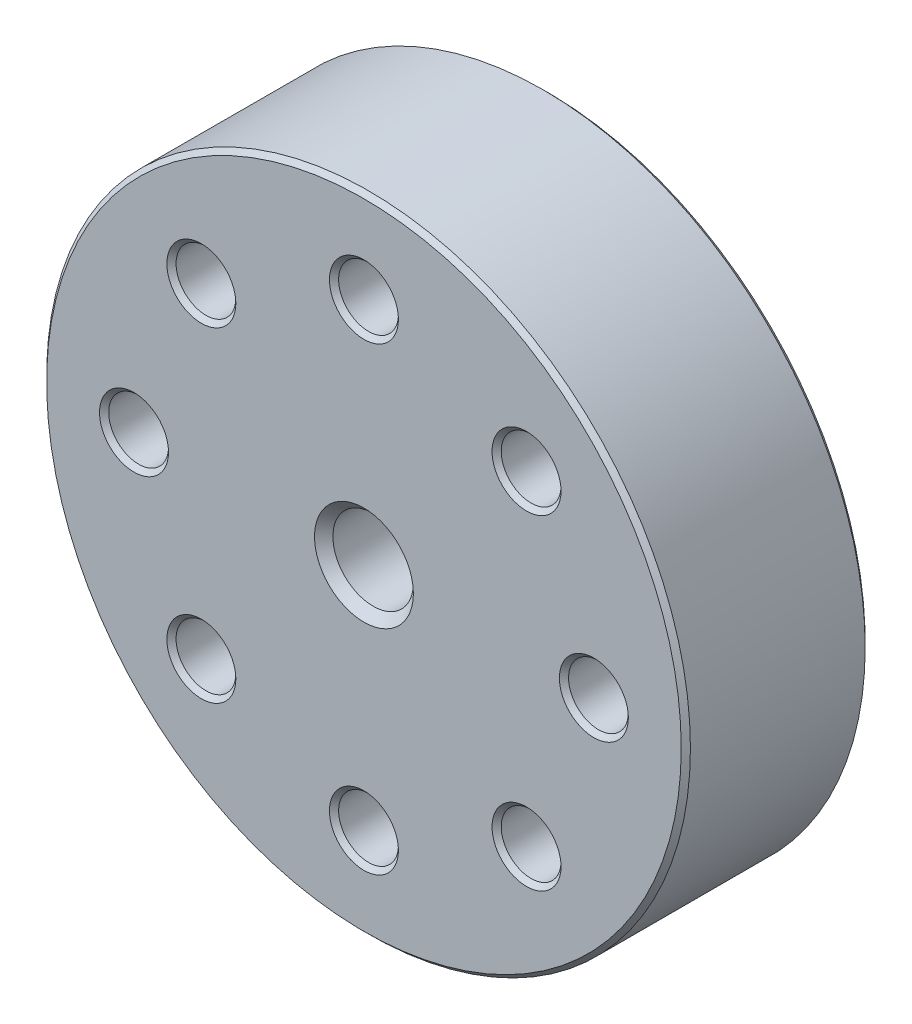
ISO-10303-21;
HEADER;
FILE_DESCRIPTION(('STEP AP214'),'2;1');
FILE_NAME('part.step','',(''),(''),'','','');
FILE_SCHEMA(('AUTOMOTIVE_DESIGN { 1 0 10303 214 1 1 1 1 }'));
ENDSEC;
DATA;
#1=APPLICATION_CONTEXT('core data for automotive mechanical design processes');
#2=APPLICATION_PROTOCOL_DEFINITION('international standard','automotive_design',2000,#1);
#3=PRODUCT_CONTEXT('',#1,'mechanical');
#4=PRODUCT('Part','Part','',(#3));
#5=PRODUCT_RELATED_PRODUCT_CATEGORY('part','',(#4));
#6=PRODUCT_DEFINITION_FORMATION('','',#4);
#7=PRODUCT_DEFINITION_CONTEXT('part definition',#1,'design');
#8=PRODUCT_DEFINITION('design','',#6,#7);
#9=PRODUCT_DEFINITION_SHAPE('','',#8);
#10=(LENGTH_UNIT() NAMED_UNIT(*) SI_UNIT(.MILLI.,.METRE.));
#11=(NAMED_UNIT(*) PLANE_ANGLE_UNIT() SI_UNIT($,.RADIAN.));
#12=(NAMED_UNIT(*) SI_UNIT($,.STERADIAN.) SOLID_ANGLE_UNIT());
#13=UNCERTAINTY_MEASURE_WITH_UNIT(LENGTH_MEASURE(1.E-05),#10,'distance_accuracy_value','');
#14=(GEOMETRIC_REPRESENTATION_CONTEXT(3) GLOBAL_UNCERTAINTY_ASSIGNED_CONTEXT((#13)) GLOBAL_UNIT_ASSIGNED_CONTEXT((#10,
#11,#12)) REPRESENTATION_CONTEXT('',''));
#15=CARTESIAN_POINT('',(0.,0.,0.));
#16=DIRECTION('',(0.,0.,1.));
#17=DIRECTION('',(1.,0.,0.));
#18=AXIS2_PLACEMENT_3D('',#15,#16,#17);
#19=CARTESIAN_POINT('',(0.,0.,0.));
#20=DIRECTION('',(0.,0.,-1.));
#21=DIRECTION('',(-1.,0.,0.));
#22=AXIS2_PLACEMENT_3D('',#19,#20,#21);
#23=CYLINDRICAL_SURFACE('',#22,1.5);
#24=CARTESIAN_POINT('',(0.,0.,-16.));
#25=DIRECTION('',(0.,0.,1.));
#26=DIRECTION('',(1.,0.,0.));
#27=AXIS2_PLACEMENT_3D('',#24,#25,#26);
#28=CIRCLE('',#27,1.5);
#29=CARTESIAN_POINT('',(1.5,0.,-16.));
#30=VERTEX_POINT('',#29);
#31=EDGE_CURVE('E173',#30,#30,#28,.F.);
#32=ORIENTED_EDGE('',*,*,#31,.F.);
#33=EDGE_LOOP('',(#32));
#34=FACE_BOUND('',#33,.T.);
#35=CARTESIAN_POINT('',(0.,0.,-34.));
#36=DIRECTION('',(0.,0.,-1.));
#37=DIRECTION('',(-1.,0.,0.));
#38=AXIS2_PLACEMENT_3D('',#35,#36,#37);
#39=CIRCLE('',#38,1.5);
#40=CARTESIAN_POINT('',(-1.5,0.,-34.));
#41=VERTEX_POINT('',#40);
#42=EDGE_CURVE('E181',#41,#41,#39,.F.);
#43=ORIENTED_EDGE('',*,*,#42,.F.);
#44=EDGE_LOOP('',(#43));
#45=FACE_BOUND('',#44,.T.);
#46=ADVANCED_FACE('F32',(#34,#45),#23,.F.);
#47=CARTESIAN_POINT('',(0.,0.,115.669329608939));
#48=DIRECTION('',(0.,0.,1.));
#49=DIRECTION('',(1.,0.,0.));
#50=AXIS2_PLACEMENT_3D('',#47,#48,#49);
#51=CYLINDRICAL_SURFACE('',#50,5.);
#52=CARTESIAN_POINT('',(0.,0.,-33.));
#53=DIRECTION('',(0.,0.,-1.));
#54=DIRECTION('',(-1.,0.,0.));
#55=AXIS2_PLACEMENT_3D('',#52,#53,#54);
#56=CIRCLE('',#55,5.);
#57=CARTESIAN_POINT('',(-5.,0.,-33.));
#58=VERTEX_POINT('',#57);
#59=EDGE_CURVE('E39',#58,#58,#56,.F.);
#60=ORIENTED_EDGE('',*,*,#59,.T.);
#61=EDGE_LOOP('',(#60));
#62=FACE_BOUND('',#61,.T.);
#63=CARTESIAN_POINT('',(0.,0.,-23.5));
#64=DIRECTION('',(0.,0.,1.));
#65=DIRECTION('',(1.,0.,0.));
#66=AXIS2_PLACEMENT_3D('',#63,#64,#65);
#67=CIRCLE('',#66,5.);
#68=CARTESIAN_POINT('',(5.,0.,-23.5));
#69=VERTEX_POINT('',#68);
#70=EDGE_CURVE('E70',#69,#69,#67,.F.);
#71=ORIENTED_EDGE('',*,*,#70,.T.);
#72=EDGE_LOOP('',(#71));
#73=FACE_BOUND('',#72,.T.);
#74=ADVANCED_FACE('F188',(#62,#73),#51,.T.);
#75=CARTESIAN_POINT('',(0.,-4.25,-23.));
#76=DIRECTION('',(0.,0.,1.));
#77=DIRECTION('',(1.,0.,0.));
#78=AXIS2_PLACEMENT_3D('',#75,#76,#77);
#79=PLANE('',#78);
#80=CARTESIAN_POINT('',(0.,0.,-23.));
#81=DIRECTION('',(0.,0.,1.));
#82=DIRECTION('',(1.,0.,0.));
#83=AXIS2_PLACEMENT_3D('',#80,#81,#82);
#84=CIRCLE('',#83,4.49999999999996);
#85=CARTESIAN_POINT('',(4.49999999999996,0.,-23.));
#86=VERTEX_POINT('',#85);
#87=EDGE_CURVE('E73',#86,#86,#84,.T.);
#88=ORIENTED_EDGE('',*,*,#87,.T.);
#89=EDGE_LOOP('',(#88));
#90=FACE_BOUND('',#89,.T.);
#91=CARTESIAN_POINT('',(0.,0.,-23.));
#92=DIRECTION('',(0.,0.,1.));
#93=DIRECTION('',(1.,0.,0.));
#94=AXIS2_PLACEMENT_3D('',#91,#92,#93);
#95=CIRCLE('',#94,4.25);
#96=CARTESIAN_POINT('',(4.25,0.,-23.));
#97=VERTEX_POINT('',#96);
#98=EDGE_CURVE('E172',#97,#97,#95,.T.);
#99=ORIENTED_EDGE('',*,*,#98,.F.);
#100=EDGE_LOOP('',(#99));
#101=FACE_BOUND('',#100,.T.);
#102=ADVANCED_FACE('F194',(#90,#101),#79,.T.);
#103=CARTESIAN_POINT('',(0.,0.,115.669329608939));
#104=DIRECTION('',(0.,0.,1.));
#105=DIRECTION('',(1.,0.,0.));
#106=AXIS2_PLACEMENT_3D('',#103,#104,#105);
#107=CYLINDRICAL_SURFACE('',#106,4.25);
#108=CARTESIAN_POINT('',(0.,0.,-20.5));
#109=DIRECTION('',(0.,0.,-1.));
#110=DIRECTION('',(-1.,0.,0.));
#111=AXIS2_PLACEMENT_3D('',#108,#109,#110);
#112=CIRCLE('',#111,4.25);
#113=CARTESIAN_POINT('',(-4.25,0.,-20.5));
#114=VERTEX_POINT('',#113);
#115=EDGE_CURVE('E61',#114,#114,#112,.T.);
#116=ORIENTED_EDGE('',*,*,#115,.T.);
#117=EDGE_LOOP('',(#116));
#118=FACE_BOUND('',#117,.T.);
#119=ORIENTED_EDGE('',*,*,#98,.T.);
#120=EDGE_LOOP('',(#119));
#121=FACE_BOUND('',#120,.T.);
#122=ADVANCED_FACE('F213',(#118,#121),#107,.T.);
#123=CARTESIAN_POINT('',(0.,-35.,-20.));
#124=DIRECTION('',(0.,0.,-1.));
#125=DIRECTION('',(-1.,0.,0.));
#126=AXIS2_PLACEMENT_3D('',#123,#124,#125);
#127=PLANE('',#126);
#128=CARTESIAN_POINT('',(0.,0.,-20.));
#129=DIRECTION('',(0.,0.,-1.));
#130=DIRECTION('',(-1.,0.,0.));
#131=AXIS2_PLACEMENT_3D('',#128,#129,#130);
#132=CIRCLE('',#131,4.74999999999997);
#133=CARTESIAN_POINT('',(-4.74999999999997,0.,-20.));
#134=VERTEX_POINT('',#133);
#135=EDGE_CURVE('E64',#134,#134,#132,.F.);
#136=ORIENTED_EDGE('',*,*,#135,.T.);
#137=EDGE_LOOP('',(#136));
#138=FACE_BOUND('',#137,.T.);
#139=CARTESIAN_POINT('',(0.,0.,-20.));
#140=DIRECTION('',(0.,0.,-1.));
#141=DIRECTION('',(-1.,0.,0.));
#142=AXIS2_PLACEMENT_3D('',#139,#140,#141);
#143=CIRCLE('',#142,34.5);
#144=CARTESIAN_POINT('',(-34.5,0.,-20.));
#145=VERTEX_POINT('',#144);
#146=EDGE_CURVE('E67',#145,#145,#143,.T.);
#147=ORIENTED_EDGE('',*,*,#146,.T.);
#148=EDGE_LOOP('',(#147));
#149=FACE_BOUND('',#148,.T.);
#150=CARTESIAN_POINT('',(-17.6776695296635,17.6776695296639,-20.));
#151=DIRECTION('',(0.,0.,-1.));
#152=DIRECTION('',(-1.,0.,0.));
#153=AXIS2_PLACEMENT_3D('',#150,#151,#152);
#154=CIRCLE('',#153,3.75000000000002);
#155=CARTESIAN_POINT('',(-21.4276695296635,17.6776695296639,-20.));
#156=VERTEX_POINT('',#155);
#157=EDGE_CURVE('E79',#156,#156,#154,.F.);
#158=ORIENTED_EDGE('',*,*,#157,.T.);
#159=EDGE_LOOP('',(#158));
#160=FACE_BOUND('',#159,.T.);
#161=CARTESIAN_POINT('',(-25.,2.61861252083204E-13,-20.));
#162=DIRECTION('',(0.,0.,-1.));
#163=DIRECTION('',(-1.,0.,0.));
#164=AXIS2_PLACEMENT_3D('',#161,#162,#163);
#165=CIRCLE('',#164,3.75000000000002);
#166=CARTESIAN_POINT('',(-28.75,2.61861252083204E-13,-20.));
#167=VERTEX_POINT('',#166);
#168=EDGE_CURVE('E91',#167,#167,#165,.F.);
#169=ORIENTED_EDGE('',*,*,#168,.T.);
#170=EDGE_LOOP('',(#169));
#171=FACE_BOUND('',#170,.T.);
#172=CARTESIAN_POINT('',(-17.6776695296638,-17.6776695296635,-20.));
#173=DIRECTION('',(0.,0.,-1.));
#174=DIRECTION('',(-1.,0.,0.));
#175=AXIS2_PLACEMENT_3D('',#172,#173,#174);
#176=CIRCLE('',#175,3.75000000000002);
#177=CARTESIAN_POINT('',(-21.4276695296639,-17.6776695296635,-20.));
#178=VERTEX_POINT('',#177);
#179=EDGE_CURVE('E103',#178,#178,#176,.F.);
#180=ORIENTED_EDGE('',*,*,#179,.T.);
#181=EDGE_LOOP('',(#180));
#182=FACE_BOUND('',#181,.T.);
#183=CARTESIAN_POINT('',(-1.74574168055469E-13,-25.,-20.));
#184=DIRECTION('',(0.,0.,-1.));
#185=DIRECTION('',(-1.,0.,0.));
#186=AXIS2_PLACEMENT_3D('',#183,#184,#185);
#187=CIRCLE('',#186,3.75000000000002);
#188=CARTESIAN_POINT('',(-3.75000000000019,-25.,-20.));
#189=VERTEX_POINT('',#188);
#190=EDGE_CURVE('E115',#189,#189,#187,.F.);
#191=ORIENTED_EDGE('',*,*,#190,.T.);
#192=EDGE_LOOP('',(#191));
#193=FACE_BOUND('',#192,.T.);
#194=CARTESIAN_POINT('',(17.6776695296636,-17.6776695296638,-20.));
#195=DIRECTION('',(0.,0.,-1.));
#196=DIRECTION('',(-1.,0.,0.));
#197=AXIS2_PLACEMENT_3D('',#194,#195,#196);
#198=CIRCLE('',#197,3.75000000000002);
#199=CARTESIAN_POINT('',(13.9276695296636,-17.6776695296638,-20.));
#200=VERTEX_POINT('',#199);
#201=EDGE_CURVE('E127',#200,#200,#198,.F.);
#202=ORIENTED_EDGE('',*,*,#201,.T.);
#203=EDGE_LOOP('',(#202));
#204=FACE_BOUND('',#203,.T.);
#205=CARTESIAN_POINT('',(25.,0.,-20.));
#206=DIRECTION('',(0.,0.,-1.));
#207=DIRECTION('',(-1.,0.,0.));
#208=AXIS2_PLACEMENT_3D('',#205,#206,#207);
#209=CIRCLE('',#208,3.75000000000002);
#210=CARTESIAN_POINT('',(21.25,0.,-20.));
#211=VERTEX_POINT('',#210);
#212=EDGE_CURVE('E139',#211,#211,#209,.F.);
#213=ORIENTED_EDGE('',*,*,#212,.T.);
#214=EDGE_LOOP('',(#213));
#215=FACE_BOUND('',#214,.T.);
#216=CARTESIAN_POINT('',(17.6776695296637,17.6776695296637,-20.));
#217=DIRECTION('',(0.,0.,-1.));
#218=DIRECTION('',(-1.,0.,0.));
#219=AXIS2_PLACEMENT_3D('',#216,#217,#218);
#220=CIRCLE('',#219,3.74999999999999);
#221=CARTESIAN_POINT('',(13.9276695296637,17.6776695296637,-20.));
#222=VERTEX_POINT('',#221);
#223=EDGE_CURVE('E151',#222,#222,#220,.F.);
#224=ORIENTED_EDGE('',*,*,#223,.T.);
#225=EDGE_LOOP('',(#224));
#226=FACE_BOUND('',#225,.T.);
#227=CARTESIAN_POINT('',(0.,25.,-20.));
#228=DIRECTION('',(0.,0.,-1.));
#229=DIRECTION('',(-1.,0.,0.));
#230=AXIS2_PLACEMENT_3D('',#227,#228,#229);
#231=CIRCLE('',#230,3.75000000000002);
#232=CARTESIAN_POINT('',(-3.75000000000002,25.,-20.));
#233=VERTEX_POINT('',#232);
#234=EDGE_CURVE('E163',#233,#233,#231,.F.);
#235=ORIENTED_EDGE('',*,*,#234,.T.);
#236=EDGE_LOOP('',(#235));
#237=FACE_BOUND('',#236,.T.);
#238=ADVANCED_FACE('F209',(#138,#149,#160,#171,#182,#193,#204,#215,#226,#237),#127,.T.);
#239=CARTESIAN_POINT('',(0.,0.,115.669329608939));
#240=DIRECTION('',(0.,0.,1.));
#241=DIRECTION('',(1.,0.,0.));
#242=AXIS2_PLACEMENT_3D('',#239,#240,#241);
#243=CYLINDRICAL_SURFACE('',#242,35.);
#244=CARTESIAN_POINT('',(0.,0.,-0.499999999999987));
#245=DIRECTION('',(0.,0.,1.));
#246=DIRECTION('',(1.,0.,0.));
#247=AXIS2_PLACEMENT_3D('',#244,#245,#246);
#248=CIRCLE('',#247,35.);
#249=CARTESIAN_POINT('',(35.,0.,-0.499999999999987));
#250=VERTEX_POINT('',#249);
#251=EDGE_CURVE('E52',#250,#250,#248,.F.);
#252=ORIENTED_EDGE('',*,*,#251,.T.);
#253=EDGE_LOOP('',(#252));
#254=FACE_BOUND('',#253,.T.);
#255=CARTESIAN_POINT('',(0.,0.,-19.5));
#256=DIRECTION('',(0.,0.,-1.));
#257=DIRECTION('',(-1.,0.,0.));
#258=AXIS2_PLACEMENT_3D('',#255,#256,#257);
#259=CIRCLE('',#258,35.);
#260=CARTESIAN_POINT('',(-35.,0.,-19.5));
#261=VERTEX_POINT('',#260);
#262=EDGE_CURVE('E55',#261,#261,#259,.F.);
#263=ORIENTED_EDGE('',*,*,#262,.T.);
#264=EDGE_LOOP('',(#263));
#265=FACE_BOUND('',#264,.T.);
#266=ADVANCED_FACE('F205',(#254,#265),#243,.T.);
#267=CARTESIAN_POINT('',(0.,0.,0.));
#268=DIRECTION('',(0.,0.,1.));
#269=DIRECTION('',(1.,0.,0.));
#270=AXIS2_PLACEMENT_3D('',#267,#268,#269);
#271=PLANE('',#270);
#272=CARTESIAN_POINT('',(0.,0.,0.));
#273=DIRECTION('',(0.,0.,1.));
#274=DIRECTION('',(1.,0.,0.));
#275=AXIS2_PLACEMENT_3D('',#272,#273,#274);
#276=CIRCLE('',#275,5.37499999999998);
#277=CARTESIAN_POINT('',(5.37499999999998,0.,0.));
#278=VERTEX_POINT('',#277);
#279=EDGE_CURVE('E43',#278,#278,#276,.F.);
#280=ORIENTED_EDGE('',*,*,#279,.T.);
#281=EDGE_LOOP('',(#280));
#282=FACE_BOUND('',#281,.T.);
#283=CARTESIAN_POINT('',(0.,0.,0.));
#284=DIRECTION('',(0.,0.,1.));
#285=DIRECTION('',(1.,0.,0.));
#286=AXIS2_PLACEMENT_3D('',#283,#284,#285);
#287=CIRCLE('',#286,34.5);
#288=CARTESIAN_POINT('',(34.5,0.,0.));
#289=VERTEX_POINT('',#288);
#290=EDGE_CURVE('E58',#289,#289,#287,.T.);
#291=ORIENTED_EDGE('',*,*,#290,.T.);
#292=EDGE_LOOP('',(#291));
#293=FACE_BOUND('',#292,.T.);
#294=CARTESIAN_POINT('',(-17.6776695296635,17.6776695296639,0.));
#295=DIRECTION('',(0.,0.,1.));
#296=DIRECTION('',(1.,0.,0.));
#297=AXIS2_PLACEMENT_3D('',#294,#295,#296);
#298=CIRCLE('',#297,3.74999999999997);
#299=CARTESIAN_POINT('',(-13.9276695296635,17.6776695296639,0.));
#300=VERTEX_POINT('',#299);
#301=EDGE_CURVE('E76',#300,#300,#298,.F.);
#302=ORIENTED_EDGE('',*,*,#301,.T.);
#303=EDGE_LOOP('',(#302));
#304=FACE_BOUND('',#303,.T.);
#305=CARTESIAN_POINT('',(-25.,2.61861252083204E-13,0.));
#306=DIRECTION('',(0.,0.,1.));
#307=DIRECTION('',(1.,0.,0.));
#308=AXIS2_PLACEMENT_3D('',#305,#306,#307);
#309=CIRCLE('',#308,3.74999999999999);
#310=CARTESIAN_POINT('',(-21.25,2.61861252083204E-13,0.));
#311=VERTEX_POINT('',#310);
#312=EDGE_CURVE('E88',#311,#311,#309,.F.);
#313=ORIENTED_EDGE('',*,*,#312,.T.);
#314=EDGE_LOOP('',(#313));
#315=FACE_BOUND('',#314,.T.);
#316=CARTESIAN_POINT('',(-17.6776695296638,-17.6776695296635,0.));
#317=DIRECTION('',(0.,0.,1.));
#318=DIRECTION('',(1.,0.,0.));
#319=AXIS2_PLACEMENT_3D('',#316,#317,#318);
#320=CIRCLE('',#319,3.75000000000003);
#321=CARTESIAN_POINT('',(-13.9276695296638,-17.6776695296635,0.));
#322=VERTEX_POINT('',#321);
#323=EDGE_CURVE('E100',#322,#322,#320,.F.);
#324=ORIENTED_EDGE('',*,*,#323,.T.);
#325=EDGE_LOOP('',(#324));
#326=FACE_BOUND('',#325,.T.);
#327=CARTESIAN_POINT('',(-1.74574168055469E-13,-25.,0.));
#328=DIRECTION('',(0.,0.,1.));
#329=DIRECTION('',(1.,0.,0.));
#330=AXIS2_PLACEMENT_3D('',#327,#328,#329);
#331=CIRCLE('',#330,3.74999999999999);
#332=CARTESIAN_POINT('',(3.74999999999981,-25.,0.));
#333=VERTEX_POINT('',#332);
#334=EDGE_CURVE('E112',#333,#333,#331,.F.);
#335=ORIENTED_EDGE('',*,*,#334,.T.);
#336=EDGE_LOOP('',(#335));
#337=FACE_BOUND('',#336,.T.);
#338=CARTESIAN_POINT('',(17.6776695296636,-17.6776695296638,0.));
#339=DIRECTION('',(0.,0.,1.));
#340=DIRECTION('',(1.,0.,0.));
#341=AXIS2_PLACEMENT_3D('',#338,#339,#340);
#342=CIRCLE('',#341,3.74999999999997);
#343=CARTESIAN_POINT('',(21.4276695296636,-17.6776695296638,0.));
#344=VERTEX_POINT('',#343);
#345=EDGE_CURVE('E124',#344,#344,#342,.F.);
#346=ORIENTED_EDGE('',*,*,#345,.T.);
#347=EDGE_LOOP('',(#346));
#348=FACE_BOUND('',#347,.T.);
#349=CARTESIAN_POINT('',(25.,0.,0.));
#350=DIRECTION('',(0.,0.,1.));
#351=DIRECTION('',(1.,0.,0.));
#352=AXIS2_PLACEMENT_3D('',#349,#350,#351);
#353=CIRCLE('',#352,3.74999999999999);
#354=CARTESIAN_POINT('',(28.75,0.,0.));
#355=VERTEX_POINT('',#354);
#356=EDGE_CURVE('E136',#355,#355,#353,.F.);
#357=ORIENTED_EDGE('',*,*,#356,.T.);
#358=EDGE_LOOP('',(#357));
#359=FACE_BOUND('',#358,.T.);
#360=CARTESIAN_POINT('',(17.6776695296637,17.6776695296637,0.));
#361=DIRECTION('',(0.,0.,1.));
#362=DIRECTION('',(1.,0.,0.));
#363=AXIS2_PLACEMENT_3D('',#360,#361,#362);
#364=CIRCLE('',#363,3.74999999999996);
#365=CARTESIAN_POINT('',(21.4276695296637,17.6776695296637,0.));
#366=VERTEX_POINT('',#365);
#367=EDGE_CURVE('E148',#366,#366,#364,.F.);
#368=ORIENTED_EDGE('',*,*,#367,.T.);
#369=EDGE_LOOP('',(#368));
#370=FACE_BOUND('',#369,.T.);
#371=CARTESIAN_POINT('',(0.,25.,0.));
#372=DIRECTION('',(0.,0.,1.));
#373=DIRECTION('',(1.,0.,0.));
#374=AXIS2_PLACEMENT_3D('',#371,#372,#373);
#375=CIRCLE('',#374,3.74999999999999);
#376=CARTESIAN_POINT('',(3.74999999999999,25.,0.));
#377=VERTEX_POINT('',#376);
#378=EDGE_CURVE('E160',#377,#377,#375,.F.);
#379=ORIENTED_EDGE('',*,*,#378,.T.);
#380=EDGE_LOOP('',(#379));
#381=FACE_BOUND('',#380,.T.);
#382=ADVANCED_FACE('F201',(#282,#293,#304,#315,#326,#337,#348,#359,#370,#381),#271,.T.);
#383=CARTESIAN_POINT('',(0.,0.,-16.));
#384=DIRECTION('',(0.,0.,1.));
#385=DIRECTION('',(1.,0.,0.));
#386=AXIS2_PLACEMENT_3D('',#383,#384,#385);
#387=PLANE('',#386);
#388=CARTESIAN_POINT('',(0.,0.,-16.));
#389=DIRECTION('',(0.,0.,1.));
#390=DIRECTION('',(1.,0.,0.));
#391=AXIS2_PLACEMENT_3D('',#388,#389,#390);
#392=CIRCLE('',#391,4.375);
#393=CARTESIAN_POINT('',(4.375,0.,-16.));
#394=VERTEX_POINT('',#393);
#395=EDGE_CURVE('E176',#394,#394,#392,.T.);
#396=ORIENTED_EDGE('',*,*,#395,.T.);
#397=EDGE_LOOP('',(#396));
#398=FACE_BOUND('',#397,.T.);
#399=ORIENTED_EDGE('',*,*,#31,.T.);
#400=EDGE_LOOP('',(#399));
#401=FACE_BOUND('',#400,.T.);
#402=ADVANCED_FACE('F204',(#398,#401),#387,.T.);
#403=CARTESIAN_POINT('',(0.,0.,-16.));
#404=DIRECTION('',(0.,0.,1.));
#405=DIRECTION('',(1.,0.,0.));
#406=AXIS2_PLACEMENT_3D('',#403,#404,#405);
#407=CYLINDRICAL_SURFACE('',#406,4.375);
#408=CARTESIAN_POINT('',(0.,0.,-0.999999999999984));
#409=DIRECTION('',(0.,0.,1.));
#410=DIRECTION('',(1.,0.,0.));
#411=AXIS2_PLACEMENT_3D('',#408,#409,#410);
#412=CIRCLE('',#411,4.375);
#413=CARTESIAN_POINT('',(4.375,0.,-0.999999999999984));
#414=VERTEX_POINT('',#413);
#415=EDGE_CURVE('E47',#414,#414,#412,.T.);
#416=ORIENTED_EDGE('',*,*,#415,.T.);
#417=EDGE_LOOP('',(#416));
#418=FACE_BOUND('',#417,.T.);
#419=ORIENTED_EDGE('',*,*,#395,.F.);
#420=EDGE_LOOP('',(#419));
#421=FACE_BOUND('',#420,.T.);
#422=ADVANCED_FACE('F199',(#418,#421),#407,.F.);
#423=CARTESIAN_POINT('',(0.,0.,-34.));
#424=DIRECTION('',(0.,0.,-1.));
#425=DIRECTION('',(-1.,0.,0.));
#426=AXIS2_PLACEMENT_3D('',#423,#424,#425);
#427=PLANE('',#426);
#428=CARTESIAN_POINT('',(0.,0.,-34.));
#429=DIRECTION('',(0.,0.,-1.));
#430=DIRECTION('',(-1.,0.,0.));
#431=AXIS2_PLACEMENT_3D('',#428,#429,#430);
#432=CIRCLE('',#431,4.);
#433=CARTESIAN_POINT('',(-4.,0.,-34.));
#434=VERTEX_POINT('',#433);
#435=EDGE_CURVE('E11',#434,#434,#432,.T.);
#436=ORIENTED_EDGE('',*,*,#435,.T.);
#437=EDGE_LOOP('',(#436));
#438=FACE_BOUND('',#437,.T.);
#439=ORIENTED_EDGE('',*,*,#42,.T.);
#440=EDGE_LOOP('',(#439));
#441=FACE_BOUND('',#440,.T.);
#442=ADVANCED_FACE('F185',(#438,#441),#427,.T.);
#443=CARTESIAN_POINT('',(0.,25.,-39.));
#444=DIRECTION('',(0.,0.,1.));
#445=DIRECTION('',(1.,0.,0.));
#446=AXIS2_PLACEMENT_3D('',#443,#444,#445);
#447=CYLINDRICAL_SURFACE('',#446,3.25);
#448=CARTESIAN_POINT('',(0.,25.,-19.5));
#449=DIRECTION('',(0.,0.,-1.));
#450=DIRECTION('',(-1.,0.,0.));
#451=AXIS2_PLACEMENT_3D('',#448,#449,#450);
#452=CIRCLE('',#451,3.25);
#453=CARTESIAN_POINT('',(-3.25,25.,-19.5));
#454=VERTEX_POINT('',#453);
#455=EDGE_CURVE('E166',#454,#454,#452,.T.);
#456=ORIENTED_EDGE('',*,*,#455,.T.);
#457=EDGE_LOOP('',(#456));
#458=FACE_BOUND('',#457,.T.);
#459=CARTESIAN_POINT('',(0.,25.,-0.49999999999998));
#460=DIRECTION('',(0.,0.,1.));
#461=DIRECTION('',(1.,0.,0.));
#462=AXIS2_PLACEMENT_3D('',#459,#460,#461);
#463=CIRCLE('',#462,3.25);
#464=CARTESIAN_POINT('',(3.25,25.,-0.49999999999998));
#465=VERTEX_POINT('',#464);
#466=EDGE_CURVE('E169',#465,#465,#463,.T.);
#467=ORIENTED_EDGE('',*,*,#466,.T.);
#468=EDGE_LOOP('',(#467));
#469=FACE_BOUND('',#468,.T.);
#470=ADVANCED_FACE('F225',(#458,#469),#447,.F.);
#471=CARTESIAN_POINT('',(0.,25.,-19.5));
#472=DIRECTION('',(0.,0.,-1.));
#473=DIRECTION('',(-1.,0.,0.));
#474=AXIS2_PLACEMENT_3D('',#471,#472,#473);
#475=CONICAL_SURFACE('',#474,3.25,0.785398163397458);
#476=ORIENTED_EDGE('',*,*,#234,.F.);
#477=EDGE_LOOP('',(#476));
#478=FACE_BOUND('',#477,.T.);
#479=ORIENTED_EDGE('',*,*,#455,.F.);
#480=EDGE_LOOP('',(#479));
#481=FACE_BOUND('',#480,.T.);
#482=ADVANCED_FACE('F221',(#478,#481),#475,.F.);
#483=CARTESIAN_POINT('',(0.,25.,-0.49999999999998));
#484=DIRECTION('',(0.,0.,1.));
#485=DIRECTION('',(1.,0.,0.));
#486=AXIS2_PLACEMENT_3D('',#483,#484,#485);
#487=CONICAL_SURFACE('',#486,3.25,0.785398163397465);
#488=ORIENTED_EDGE('',*,*,#378,.F.);
#489=EDGE_LOOP('',(#488));
#490=FACE_BOUND('',#489,.T.);
#491=ORIENTED_EDGE('',*,*,#466,.F.);
#492=EDGE_LOOP('',(#491));
#493=FACE_BOUND('',#492,.T.);
#494=ADVANCED_FACE('F224',(#490,#493),#487,.F.);
#495=CARTESIAN_POINT('',(17.6776695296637,17.6776695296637,-39.));
#496=DIRECTION('',(0.,0.,1.));
#497=DIRECTION('',(1.,0.,0.));
#498=AXIS2_PLACEMENT_3D('',#495,#496,#497);
#499=CYLINDRICAL_SURFACE('',#498,3.25);
#500=CARTESIAN_POINT('',(17.6776695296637,17.6776695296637,-19.5));
#501=DIRECTION('',(0.,0.,-1.));
#502=DIRECTION('',(-1.,0.,0.));
#503=AXIS2_PLACEMENT_3D('',#500,#501,#502);
#504=CIRCLE('',#503,3.25);
#505=CARTESIAN_POINT('',(14.4276695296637,17.6776695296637,-19.5));
#506=VERTEX_POINT('',#505);
#507=EDGE_CURVE('E154',#506,#506,#504,.T.);
#508=ORIENTED_EDGE('',*,*,#507,.T.);
#509=EDGE_LOOP('',(#508));
#510=FACE_BOUND('',#509,.T.);
#511=CARTESIAN_POINT('',(17.6776695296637,17.6776695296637,-0.499999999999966));
#512=DIRECTION('',(0.,0.,1.));
#513=DIRECTION('',(1.,0.,0.));
#514=AXIS2_PLACEMENT_3D('',#511,#512,#513);
#515=CIRCLE('',#514,3.25);
#516=CARTESIAN_POINT('',(20.9276695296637,17.6776695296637,-0.499999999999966));
#517=VERTEX_POINT('',#516);
#518=EDGE_CURVE('E157',#517,#517,#515,.T.);
#519=ORIENTED_EDGE('',*,*,#518,.T.);
#520=EDGE_LOOP('',(#519));
#521=FACE_BOUND('',#520,.T.);
#522=ADVANCED_FACE('F229',(#510,#521),#499,.F.);
#523=CARTESIAN_POINT('',(25.,0.,-39.));
#524=DIRECTION('',(0.,0.,1.));
#525=DIRECTION('',(1.,0.,0.));
#526=AXIS2_PLACEMENT_3D('',#523,#524,#525);
#527=CYLINDRICAL_SURFACE('',#526,3.25);
#528=CARTESIAN_POINT('',(25.,0.,-19.5));
#529=DIRECTION('',(0.,0.,-1.));
#530=DIRECTION('',(-1.,0.,0.));
#531=AXIS2_PLACEMENT_3D('',#528,#529,#530);
#532=CIRCLE('',#531,3.25);
#533=CARTESIAN_POINT('',(21.75,0.,-19.5));
#534=VERTEX_POINT('',#533);
#535=EDGE_CURVE('E142',#534,#534,#532,.T.);
#536=ORIENTED_EDGE('',*,*,#535,.T.);
#537=EDGE_LOOP('',(#536));
#538=FACE_BOUND('',#537,.T.);
#539=CARTESIAN_POINT('',(25.,0.,-0.49999999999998));
#540=DIRECTION('',(0.,0.,1.));
#541=DIRECTION('',(1.,0.,0.));
#542=AXIS2_PLACEMENT_3D('',#539,#540,#541);
#543=CIRCLE('',#542,3.25);
#544=CARTESIAN_POINT('',(28.25,0.,-0.49999999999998));
#545=VERTEX_POINT('',#544);
#546=EDGE_CURVE('E145',#545,#545,#543,.T.);
#547=ORIENTED_EDGE('',*,*,#546,.T.);
#548=EDGE_LOOP('',(#547));
#549=FACE_BOUND('',#548,.T.);
#550=ADVANCED_FACE('F330',(#538,#549),#527,.F.);
#551=CARTESIAN_POINT('',(17.6776695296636,-17.6776695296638,-39.));
#552=DIRECTION('',(0.,0.,1.));
#553=DIRECTION('',(1.,0.,0.));
#554=AXIS2_PLACEMENT_3D('',#551,#552,#553);
#555=CYLINDRICAL_SURFACE('',#554,3.25);
#556=CARTESIAN_POINT('',(17.6776695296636,-17.6776695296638,-19.5));
#557=DIRECTION('',(0.,0.,-1.));
#558=DIRECTION('',(-1.,0.,0.));
#559=AXIS2_PLACEMENT_3D('',#556,#557,#558);
#560=CIRCLE('',#559,3.25);
#561=CARTESIAN_POINT('',(14.4276695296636,-17.6776695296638,-19.5));
#562=VERTEX_POINT('',#561);
#563=EDGE_CURVE('E130',#562,#562,#560,.T.);
#564=ORIENTED_EDGE('',*,*,#563,.T.);
#565=EDGE_LOOP('',(#564));
#566=FACE_BOUND('',#565,.T.);
#567=CARTESIAN_POINT('',(17.6776695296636,-17.6776695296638,-0.499999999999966));
#568=DIRECTION('',(0.,0.,1.));
#569=DIRECTION('',(1.,0.,0.));
#570=AXIS2_PLACEMENT_3D('',#567,#568,#569);
#571=CIRCLE('',#570,3.25);
#572=CARTESIAN_POINT('',(20.9276695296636,-17.6776695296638,-0.499999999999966));
#573=VERTEX_POINT('',#572);
#574=EDGE_CURVE('E133',#573,#573,#571,.T.);
#575=ORIENTED_EDGE('',*,*,#574,.T.);
#576=EDGE_LOOP('',(#575));
#577=FACE_BOUND('',#576,.T.);
#578=ADVANCED_FACE('F334',(#566,#577),#555,.F.);
#579=CARTESIAN_POINT('',(-1.74574168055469E-13,-25.,-39.));
#580=DIRECTION('',(0.,0.,1.));
#581=DIRECTION('',(1.,0.,0.));
#582=AXIS2_PLACEMENT_3D('',#579,#580,#581);
#583=CYLINDRICAL_SURFACE('',#582,3.25);
#584=CARTESIAN_POINT('',(-1.74574168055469E-13,-25.,-19.5));
#585=DIRECTION('',(0.,0.,-1.));
#586=DIRECTION('',(-1.,0.,0.));
#587=AXIS2_PLACEMENT_3D('',#584,#585,#586);
#588=CIRCLE('',#587,3.25);
#589=CARTESIAN_POINT('',(-3.25000000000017,-25.,-19.5));
#590=VERTEX_POINT('',#589);
#591=EDGE_CURVE('E118',#590,#590,#588,.T.);
#592=ORIENTED_EDGE('',*,*,#591,.T.);
#593=EDGE_LOOP('',(#592));
#594=FACE_BOUND('',#593,.T.);
#595=CARTESIAN_POINT('',(-1.74574168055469E-13,-25.,-0.49999999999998));
#596=DIRECTION('',(0.,0.,1.));
#597=DIRECTION('',(1.,0.,0.));
#598=AXIS2_PLACEMENT_3D('',#595,#596,#597);
#599=CIRCLE('',#598,3.25);
#600=CARTESIAN_POINT('',(3.24999999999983,-25.,-0.49999999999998));
#601=VERTEX_POINT('',#600);
#602=EDGE_CURVE('E121',#601,#601,#599,.T.);
#603=ORIENTED_EDGE('',*,*,#602,.T.);
#604=EDGE_LOOP('',(#603));
#605=FACE_BOUND('',#604,.T.);
#606=ADVANCED_FACE('F338',(#594,#605),#583,.F.);
#607=CARTESIAN_POINT('',(-17.6776695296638,-17.6776695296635,-39.));
#608=DIRECTION('',(0.,0.,1.));
#609=DIRECTION('',(1.,0.,0.));
#610=AXIS2_PLACEMENT_3D('',#607,#608,#609);
#611=CYLINDRICAL_SURFACE('',#610,3.25);
#612=CARTESIAN_POINT('',(-17.6776695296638,-17.6776695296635,-19.5));
#613=DIRECTION('',(0.,0.,-1.));
#614=DIRECTION('',(-1.,0.,0.));
#615=AXIS2_PLACEMENT_3D('',#612,#613,#614);
#616=CIRCLE('',#615,3.25);
#617=CARTESIAN_POINT('',(-20.9276695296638,-17.6776695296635,-19.5));
#618=VERTEX_POINT('',#617);
#619=EDGE_CURVE('E106',#618,#618,#616,.T.);
#620=ORIENTED_EDGE('',*,*,#619,.T.);
#621=EDGE_LOOP('',(#620));
#622=FACE_BOUND('',#621,.T.);
#623=CARTESIAN_POINT('',(-17.6776695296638,-17.6776695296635,-0.500000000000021));
#624=DIRECTION('',(0.,0.,1.));
#625=DIRECTION('',(1.,0.,0.));
#626=AXIS2_PLACEMENT_3D('',#623,#624,#625);
#627=CIRCLE('',#626,3.25);
#628=CARTESIAN_POINT('',(-14.4276695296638,-17.6776695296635,-0.500000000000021));
#629=VERTEX_POINT('',#628);
#630=EDGE_CURVE('E109',#629,#629,#627,.T.);
#631=ORIENTED_EDGE('',*,*,#630,.T.);
#632=EDGE_LOOP('',(#631));
#633=FACE_BOUND('',#632,.T.);
#634=ADVANCED_FACE('F342',(#622,#633),#611,.F.);
#635=CARTESIAN_POINT('',(-25.,2.61861252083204E-13,-39.));
#636=DIRECTION('',(0.,0.,1.));
#637=DIRECTION('',(1.,0.,0.));
#638=AXIS2_PLACEMENT_3D('',#635,#636,#637);
#639=CYLINDRICAL_SURFACE('',#638,3.25);
#640=CARTESIAN_POINT('',(-25.,2.61861252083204E-13,-19.5));
#641=DIRECTION('',(0.,0.,-1.));
#642=DIRECTION('',(-1.,0.,0.));
#643=AXIS2_PLACEMENT_3D('',#640,#641,#642);
#644=CIRCLE('',#643,3.25);
#645=CARTESIAN_POINT('',(-28.25,2.61861252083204E-13,-19.5));
#646=VERTEX_POINT('',#645);
#647=EDGE_CURVE('E94',#646,#646,#644,.T.);
#648=ORIENTED_EDGE('',*,*,#647,.T.);
#649=EDGE_LOOP('',(#648));
#650=FACE_BOUND('',#649,.T.);
#651=CARTESIAN_POINT('',(-25.,2.61861252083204E-13,-0.49999999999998));
#652=DIRECTION('',(0.,0.,1.));
#653=DIRECTION('',(1.,0.,0.));
#654=AXIS2_PLACEMENT_3D('',#651,#652,#653);
#655=CIRCLE('',#654,3.25);
#656=CARTESIAN_POINT('',(-21.75,2.61861252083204E-13,-0.49999999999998));
#657=VERTEX_POINT('',#656);
#658=EDGE_CURVE('E97',#657,#657,#655,.T.);
#659=ORIENTED_EDGE('',*,*,#658,.T.);
#660=EDGE_LOOP('',(#659));
#661=FACE_BOUND('',#660,.T.);
#662=ADVANCED_FACE('F346',(#650,#661),#639,.F.);
#663=CARTESIAN_POINT('',(-17.6776695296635,17.6776695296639,-39.));
#664=DIRECTION('',(0.,0.,1.));
#665=DIRECTION('',(1.,0.,0.));
#666=AXIS2_PLACEMENT_3D('',#663,#664,#665);
#667=CYLINDRICAL_SURFACE('',#666,3.25);
#668=CARTESIAN_POINT('',(-17.6776695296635,17.6776695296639,-19.5));
#669=DIRECTION('',(0.,0.,-1.));
#670=DIRECTION('',(-1.,0.,0.));
#671=AXIS2_PLACEMENT_3D('',#668,#669,#670);
#672=CIRCLE('',#671,3.25);
#673=CARTESIAN_POINT('',(-20.9276695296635,17.6776695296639,-19.5));
#674=VERTEX_POINT('',#673);
#675=EDGE_CURVE('E82',#674,#674,#672,.T.);
#676=ORIENTED_EDGE('',*,*,#675,.T.);
#677=EDGE_LOOP('',(#676));
#678=FACE_BOUND('',#677,.T.);
#679=CARTESIAN_POINT('',(-17.6776695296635,17.6776695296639,-0.49999999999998));
#680=DIRECTION('',(0.,0.,1.));
#681=DIRECTION('',(1.,0.,0.));
#682=AXIS2_PLACEMENT_3D('',#679,#680,#681);
#683=CIRCLE('',#682,3.25);
#684=CARTESIAN_POINT('',(-14.4276695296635,17.6776695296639,-0.49999999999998));
#685=VERTEX_POINT('',#684);
#686=EDGE_CURVE('E85',#685,#685,#683,.T.);
#687=ORIENTED_EDGE('',*,*,#686,.T.);
#688=EDGE_LOOP('',(#687));
#689=FACE_BOUND('',#688,.T.);
#690=ADVANCED_FACE('F235',(#678,#689),#667,.F.);
#691=CARTESIAN_POINT('',(17.6776695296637,17.6776695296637,-19.5));
#692=DIRECTION('',(0.,0.,-1.));
#693=DIRECTION('',(-1.,0.,0.));
#694=AXIS2_PLACEMENT_3D('',#691,#692,#693);
#695=CONICAL_SURFACE('',#694,3.25,0.785398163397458);
#696=ORIENTED_EDGE('',*,*,#223,.F.);
#697=EDGE_LOOP('',(#696));
#698=FACE_BOUND('',#697,.T.);
#699=ORIENTED_EDGE('',*,*,#507,.F.);
#700=EDGE_LOOP('',(#699));
#701=FACE_BOUND('',#700,.T.);
#702=ADVANCED_FACE('F231',(#698,#701),#695,.F.);
#703=CARTESIAN_POINT('',(17.6776695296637,17.6776695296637,-0.499999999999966));
#704=DIRECTION('',(0.,0.,1.));
#705=DIRECTION('',(1.,0.,0.));
#706=AXIS2_PLACEMENT_3D('',#703,#704,#705);
#707=CONICAL_SURFACE('',#706,3.25,0.785398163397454);
#708=ORIENTED_EDGE('',*,*,#367,.F.);
#709=EDGE_LOOP('',(#708));
#710=FACE_BOUND('',#709,.T.);
#711=ORIENTED_EDGE('',*,*,#518,.F.);
#712=EDGE_LOOP('',(#711));
#713=FACE_BOUND('',#712,.T.);
#714=ADVANCED_FACE('F234',(#710,#713),#707,.F.);
#715=CARTESIAN_POINT('',(25.,0.,-19.5));
#716=DIRECTION('',(0.,0.,-1.));
#717=DIRECTION('',(-1.,0.,0.));
#718=AXIS2_PLACEMENT_3D('',#715,#716,#717);
#719=CONICAL_SURFACE('',#718,3.25,0.785398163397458);
#720=ORIENTED_EDGE('',*,*,#212,.F.);
#721=EDGE_LOOP('',(#720));
#722=FACE_BOUND('',#721,.T.);
#723=ORIENTED_EDGE('',*,*,#535,.F.);
#724=EDGE_LOOP('',(#723));
#725=FACE_BOUND('',#724,.T.);
#726=ADVANCED_FACE('F239',(#722,#725),#719,.F.);
#727=CARTESIAN_POINT('',(25.,0.,-0.49999999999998));
#728=DIRECTION('',(0.,0.,1.));
#729=DIRECTION('',(1.,0.,0.));
#730=AXIS2_PLACEMENT_3D('',#727,#728,#729);
#731=CONICAL_SURFACE('',#730,3.25,0.785398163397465);
#732=ORIENTED_EDGE('',*,*,#356,.F.);
#733=EDGE_LOOP('',(#732));
#734=FACE_BOUND('',#733,.T.);
#735=ORIENTED_EDGE('',*,*,#546,.F.);
#736=EDGE_LOOP('',(#735));
#737=FACE_BOUND('',#736,.T.);
#738=ADVANCED_FACE('F243',(#734,#737),#731,.F.);
#739=CARTESIAN_POINT('',(17.6776695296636,-17.6776695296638,-19.5));
#740=DIRECTION('',(0.,0.,-1.));
#741=DIRECTION('',(-1.,0.,0.));
#742=AXIS2_PLACEMENT_3D('',#739,#740,#741);
#743=CONICAL_SURFACE('',#742,3.25,0.785398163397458);
#744=ORIENTED_EDGE('',*,*,#201,.F.);
#745=EDGE_LOOP('',(#744));
#746=FACE_BOUND('',#745,.T.);
#747=ORIENTED_EDGE('',*,*,#563,.F.);
#748=EDGE_LOOP('',(#747));
#749=FACE_BOUND('',#748,.T.);
#750=ADVANCED_FACE('F247',(#746,#749),#743,.F.);
#751=CARTESIAN_POINT('',(17.6776695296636,-17.6776695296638,-0.499999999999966));
#752=DIRECTION('',(0.,0.,1.));
#753=DIRECTION('',(1.,0.,0.));
#754=AXIS2_PLACEMENT_3D('',#751,#752,#753);
#755=CONICAL_SURFACE('',#754,3.25,0.785398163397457);
#756=ORIENTED_EDGE('',*,*,#345,.F.);
#757=EDGE_LOOP('',(#756));
#758=FACE_BOUND('',#757,.T.);
#759=ORIENTED_EDGE('',*,*,#574,.F.);
#760=EDGE_LOOP('',(#759));
#761=FACE_BOUND('',#760,.T.);
#762=ADVANCED_FACE('F251',(#758,#761),#755,.F.);
#763=CARTESIAN_POINT('',(-1.74574168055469E-13,-25.,-19.5));
#764=DIRECTION('',(0.,0.,-1.));
#765=DIRECTION('',(-1.,0.,0.));
#766=AXIS2_PLACEMENT_3D('',#763,#764,#765);
#767=CONICAL_SURFACE('',#766,3.25,0.785398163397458);
#768=ORIENTED_EDGE('',*,*,#190,.F.);
#769=EDGE_LOOP('',(#768));
#770=FACE_BOUND('',#769,.T.);
#771=ORIENTED_EDGE('',*,*,#591,.F.);
#772=EDGE_LOOP('',(#771));
#773=FACE_BOUND('',#772,.T.);
#774=ADVANCED_FACE('F255',(#770,#773),#767,.F.);
#775=CARTESIAN_POINT('',(-1.74574168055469E-13,-25.,-0.49999999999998));
#776=DIRECTION('',(0.,0.,1.));
#777=DIRECTION('',(1.,0.,0.));
#778=AXIS2_PLACEMENT_3D('',#775,#776,#777);
#779=CONICAL_SURFACE('',#778,3.25,0.785398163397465);
#780=ORIENTED_EDGE('',*,*,#334,.F.);
#781=EDGE_LOOP('',(#780));
#782=FACE_BOUND('',#781,.T.);
#783=ORIENTED_EDGE('',*,*,#602,.F.);
#784=EDGE_LOOP('',(#783));
#785=FACE_BOUND('',#784,.T.);
#786=ADVANCED_FACE('F259',(#782,#785),#779,.F.);
#787=CARTESIAN_POINT('',(-17.6776695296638,-17.6776695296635,-19.5));
#788=DIRECTION('',(0.,0.,-1.));
#789=DIRECTION('',(-1.,0.,0.));
#790=AXIS2_PLACEMENT_3D('',#787,#788,#789);
#791=CONICAL_SURFACE('',#790,3.25,0.785398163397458);
#792=ORIENTED_EDGE('',*,*,#179,.F.);
#793=EDGE_LOOP('',(#792));
#794=FACE_BOUND('',#793,.T.);
#795=ORIENTED_EDGE('',*,*,#619,.F.);
#796=EDGE_LOOP('',(#795));
#797=FACE_BOUND('',#796,.T.);
#798=ADVANCED_FACE('F263',(#794,#797),#791,.F.);
#799=CARTESIAN_POINT('',(-17.6776695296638,-17.6776695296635,-0.500000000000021));
#800=DIRECTION('',(0.,0.,1.));
#801=DIRECTION('',(1.,0.,0.));
#802=AXIS2_PLACEMENT_3D('',#799,#800,#801);
#803=CONICAL_SURFACE('',#802,3.25,0.78539816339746);
#804=ORIENTED_EDGE('',*,*,#323,.F.);
#805=EDGE_LOOP('',(#804));
#806=FACE_BOUND('',#805,.T.);
#807=ORIENTED_EDGE('',*,*,#630,.F.);
#808=EDGE_LOOP('',(#807));
#809=FACE_BOUND('',#808,.T.);
#810=ADVANCED_FACE('F267',(#806,#809),#803,.F.);
#811=CARTESIAN_POINT('',(-25.,2.61861252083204E-13,-19.5));
#812=DIRECTION('',(0.,0.,-1.));
#813=DIRECTION('',(-1.,0.,0.));
#814=AXIS2_PLACEMENT_3D('',#811,#812,#813);
#815=CONICAL_SURFACE('',#814,3.25,0.785398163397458);
#816=ORIENTED_EDGE('',*,*,#168,.F.);
#817=EDGE_LOOP('',(#816));
#818=FACE_BOUND('',#817,.T.);
#819=ORIENTED_EDGE('',*,*,#647,.F.);
#820=EDGE_LOOP('',(#819));
#821=FACE_BOUND('',#820,.T.);
#822=ADVANCED_FACE('F271',(#818,#821),#815,.F.);
#823=CARTESIAN_POINT('',(-25.,2.61861252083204E-13,-0.49999999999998));
#824=DIRECTION('',(0.,0.,1.));
#825=DIRECTION('',(1.,0.,0.));
#826=AXIS2_PLACEMENT_3D('',#823,#824,#825);
#827=CONICAL_SURFACE('',#826,3.25,0.785398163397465);
#828=ORIENTED_EDGE('',*,*,#312,.F.);
#829=EDGE_LOOP('',(#828));
#830=FACE_BOUND('',#829,.T.);
#831=ORIENTED_EDGE('',*,*,#658,.F.);
#832=EDGE_LOOP('',(#831));
#833=FACE_BOUND('',#832,.T.);
#834=ADVANCED_FACE('F275',(#830,#833),#827,.F.);
#835=CARTESIAN_POINT('',(-17.6776695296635,17.6776695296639,-19.5));
#836=DIRECTION('',(0.,0.,-1.));
#837=DIRECTION('',(-1.,0.,0.));
#838=AXIS2_PLACEMENT_3D('',#835,#836,#837);
#839=CONICAL_SURFACE('',#838,3.25,0.785398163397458);
#840=ORIENTED_EDGE('',*,*,#157,.F.);
#841=EDGE_LOOP('',(#840));
#842=FACE_BOUND('',#841,.T.);
#843=ORIENTED_EDGE('',*,*,#675,.F.);
#844=EDGE_LOOP('',(#843));
#845=FACE_BOUND('',#844,.T.);
#846=ADVANCED_FACE('F279',(#842,#845),#839,.F.);
#847=CARTESIAN_POINT('',(-17.6776695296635,17.6776695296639,-0.49999999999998));
#848=DIRECTION('',(0.,0.,1.));
#849=DIRECTION('',(1.,0.,0.));
#850=AXIS2_PLACEMENT_3D('',#847,#848,#849);
#851=CONICAL_SURFACE('',#850,3.25,0.785398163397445);
#852=ORIENTED_EDGE('',*,*,#301,.F.);
#853=EDGE_LOOP('',(#852));
#854=FACE_BOUND('',#853,.T.);
#855=ORIENTED_EDGE('',*,*,#686,.F.);
#856=EDGE_LOOP('',(#855));
#857=FACE_BOUND('',#856,.T.);
#858=ADVANCED_FACE('F283',(#854,#857),#851,.F.);
#859=CARTESIAN_POINT('',(0.,0.,-23.));
#860=DIRECTION('',(0.,0.,-1.));
#861=DIRECTION('',(-1.,0.,0.));
#862=AXIS2_PLACEMENT_3D('',#859,#860,#861);
#863=CONICAL_SURFACE('',#862,4.49999999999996,0.785398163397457);
#864=ORIENTED_EDGE('',*,*,#70,.F.);
#865=EDGE_LOOP('',(#864));
#866=FACE_BOUND('',#865,.T.);
#867=ORIENTED_EDGE('',*,*,#87,.F.);
#868=EDGE_LOOP('',(#867));
#869=FACE_BOUND('',#868,.T.);
#870=ADVANCED_FACE('F287',(#866,#869),#863,.T.);
#871=CARTESIAN_POINT('',(0.,0.,-20.));
#872=DIRECTION('',(0.,0.,1.));
#873=DIRECTION('',(1.,0.,0.));
#874=AXIS2_PLACEMENT_3D('',#871,#872,#873);
#875=CONICAL_SURFACE('',#874,4.74999999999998,0.785398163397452);
#876=ORIENTED_EDGE('',*,*,#115,.F.);
#877=EDGE_LOOP('',(#876));
#878=FACE_BOUND('',#877,.T.);
#879=ORIENTED_EDGE('',*,*,#135,.F.);
#880=EDGE_LOOP('',(#879));
#881=FACE_BOUND('',#880,.T.);
#882=ADVANCED_FACE('F291',(#878,#881),#875,.T.);
#883=CARTESIAN_POINT('',(0.,0.,0.));
#884=DIRECTION('',(0.,0.,-1.));
#885=DIRECTION('',(-1.,0.,0.));
#886=AXIS2_PLACEMENT_3D('',#883,#884,#885);
#887=CONICAL_SURFACE('',#886,34.5,0.785398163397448);
#888=ORIENTED_EDGE('',*,*,#251,.F.);
#889=EDGE_LOOP('',(#888));
#890=FACE_BOUND('',#889,.T.);
#891=ORIENTED_EDGE('',*,*,#290,.F.);
#892=EDGE_LOOP('',(#891));
#893=FACE_BOUND('',#892,.T.);
#894=ADVANCED_FACE('F295',(#890,#893),#887,.T.);
#895=CARTESIAN_POINT('',(0.,0.,-19.5));
#896=DIRECTION('',(0.,0.,1.));
#897=DIRECTION('',(1.,0.,0.));
#898=AXIS2_PLACEMENT_3D('',#895,#896,#897);
#899=CONICAL_SURFACE('',#898,35.,0.785398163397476);
#900=ORIENTED_EDGE('',*,*,#146,.F.);
#901=EDGE_LOOP('',(#900));
#902=FACE_BOUND('',#901,.T.);
#903=ORIENTED_EDGE('',*,*,#262,.F.);
#904=EDGE_LOOP('',(#903));
#905=FACE_BOUND('',#904,.T.);
#906=ADVANCED_FACE('F299',(#902,#905),#899,.T.);
#907=CARTESIAN_POINT('',(0.,0.,-0.999999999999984));
#908=DIRECTION('',(0.,0.,1.));
#909=DIRECTION('',(1.,0.,0.));
#910=AXIS2_PLACEMENT_3D('',#907,#908,#909);
#911=CONICAL_SURFACE('',#910,4.375,0.785398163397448);
#912=ORIENTED_EDGE('',*,*,#279,.F.);
#913=EDGE_LOOP('',(#912));
#914=FACE_BOUND('',#913,.T.);
#915=ORIENTED_EDGE('',*,*,#415,.F.);
#916=EDGE_LOOP('',(#915));
#917=FACE_BOUND('',#916,.T.);
#918=ADVANCED_FACE('F302',(#914,#917),#911,.F.);
#919=CARTESIAN_POINT('',(0.,0.,-33.));
#920=DIRECTION('',(0.,0.,1.));
#921=DIRECTION('',(1.,0.,0.));
#922=AXIS2_PLACEMENT_3D('',#919,#920,#921);
#923=CONICAL_SURFACE('',#922,5.,0.785398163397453);
#924=ORIENTED_EDGE('',*,*,#435,.F.);
#925=EDGE_LOOP('',(#924));
#926=FACE_BOUND('',#925,.T.);
#927=ORIENTED_EDGE('',*,*,#59,.F.);
#928=EDGE_LOOP('',(#927));
#929=FACE_BOUND('',#928,.T.);
#930=ADVANCED_FACE('F34',(#926,#929),#923,.T.);
#931=CLOSED_SHELL('',(#46,#74,#102,#122,#238,#266,#382,#402,#422,#442,#470,#482,#494,#522,#550,
#578,#606,#634,#662,#690,#702,#714,#726,#738,#750,#762,#774,#786,#798,#810,#822,#834,#846,#858,
#870,#882,#894,#906,#918,#930));
#932=MANIFOLD_SOLID_BREP('B2',#931);
#933=ADVANCED_BREP_SHAPE_REPRESENTATION('',(#18,#932),#14);
#934=SHAPE_DEFINITION_REPRESENTATION(#9,#933);
ENDSEC;
END-ISO-10303-21;
